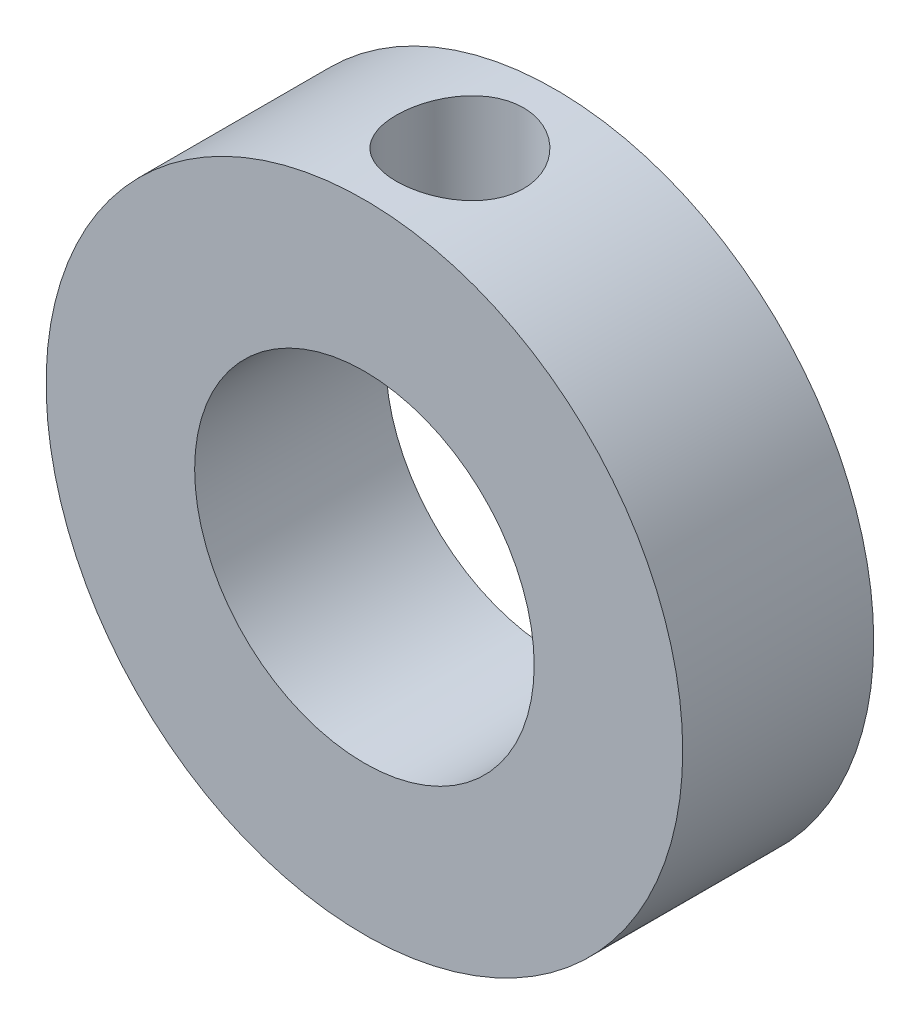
ISO-10303-21;
HEADER;
FILE_DESCRIPTION(('STEP AP214'),'2;1');
FILE_NAME('part.step','',(''),(''),'','','');
FILE_SCHEMA(('AUTOMOTIVE_DESIGN { 1 0 10303 214 1 1 1 1 }'));
ENDSEC;
DATA;
#1=APPLICATION_CONTEXT('core data for automotive mechanical design processes');
#2=APPLICATION_PROTOCOL_DEFINITION('international standard','automotive_design',2000,#1);
#3=PRODUCT_CONTEXT('',#1,'mechanical');
#4=PRODUCT('Part','Part','',(#3));
#5=PRODUCT_RELATED_PRODUCT_CATEGORY('part','',(#4));
#6=PRODUCT_DEFINITION_FORMATION('','',#4);
#7=PRODUCT_DEFINITION_CONTEXT('part definition',#1,'design');
#8=PRODUCT_DEFINITION('design','',#6,#7);
#9=PRODUCT_DEFINITION_SHAPE('','',#8);
#10=(LENGTH_UNIT() NAMED_UNIT(*) SI_UNIT(.MILLI.,.METRE.));
#11=(NAMED_UNIT(*) PLANE_ANGLE_UNIT() SI_UNIT($,.RADIAN.));
#12=(NAMED_UNIT(*) SI_UNIT($,.STERADIAN.) SOLID_ANGLE_UNIT());
#13=UNCERTAINTY_MEASURE_WITH_UNIT(LENGTH_MEASURE(1.E-05),#10,'distance_accuracy_value','');
#14=(GEOMETRIC_REPRESENTATION_CONTEXT(3) GLOBAL_UNCERTAINTY_ASSIGNED_CONTEXT((#13)) GLOBAL_UNIT_ASSIGNED_CONTEXT((#10,
#11,#12)) REPRESENTATION_CONTEXT('',''));
#15=CARTESIAN_POINT('',(0.,0.,0.));
#16=DIRECTION('',(0.,0.,1.));
#17=DIRECTION('',(1.,0.,0.));
#18=AXIS2_PLACEMENT_3D('',#15,#16,#17);
#19=CARTESIAN_POINT('',(0.,0.,4.5));
#20=DIRECTION('',(0.,0.,1.));
#21=DIRECTION('',(1.,0.,0.));
#22=AXIS2_PLACEMENT_3D('',#19,#20,#21);
#23=PLANE('',#22);
#24=CARTESIAN_POINT('',(0.,0.,4.5));
#25=DIRECTION('',(0.,0.,1.));
#26=DIRECTION('',(1.,0.,0.));
#27=AXIS2_PLACEMENT_3D('',#24,#25,#26);
#28=CIRCLE('',#27,15.);
#29=CARTESIAN_POINT('',(15.,0.,4.5));
#30=VERTEX_POINT('',#29);
#31=EDGE_CURVE('E10',#30,#30,#28,.T.);
#32=ORIENTED_EDGE('',*,*,#31,.T.);
#33=EDGE_LOOP('',(#32));
#34=FACE_BOUND('',#33,.T.);
#35=CARTESIAN_POINT('',(0.,0.,4.5));
#36=DIRECTION('',(0.,0.,1.));
#37=DIRECTION('',(1.,0.,0.));
#38=AXIS2_PLACEMENT_3D('',#35,#36,#37);
#39=CIRCLE('',#38,8.);
#40=CARTESIAN_POINT('',(8.,0.,4.5));
#41=VERTEX_POINT('',#40);
#42=EDGE_CURVE('E46',#41,#41,#39,.T.);
#43=ORIENTED_EDGE('',*,*,#42,.F.);
#44=EDGE_LOOP('',(#43));
#45=FACE_BOUND('',#44,.T.);
#46=ADVANCED_FACE('F29',(#34,#45),#23,.T.);
#47=CARTESIAN_POINT('',(0.,0.,-4.5));
#48=DIRECTION('',(0.,0.,1.));
#49=DIRECTION('',(1.,0.,0.));
#50=AXIS2_PLACEMENT_3D('',#47,#48,#49);
#51=PLANE('',#50);
#52=CARTESIAN_POINT('',(0.,0.,-4.5));
#53=DIRECTION('',(0.,0.,1.));
#54=DIRECTION('',(1.,0.,0.));
#55=AXIS2_PLACEMENT_3D('',#52,#53,#54);
#56=CIRCLE('',#55,15.);
#57=CARTESIAN_POINT('',(15.,0.,-4.5));
#58=VERTEX_POINT('',#57);
#59=EDGE_CURVE('E42',#58,#58,#56,.T.);
#60=ORIENTED_EDGE('',*,*,#59,.F.);
#61=EDGE_LOOP('',(#60));
#62=FACE_BOUND('',#61,.T.);
#63=CARTESIAN_POINT('',(0.,0.,-4.5));
#64=DIRECTION('',(0.,0.,1.));
#65=DIRECTION('',(1.,0.,0.));
#66=AXIS2_PLACEMENT_3D('',#63,#64,#65);
#67=CIRCLE('',#66,8.);
#68=CARTESIAN_POINT('',(8.,0.,-4.5));
#69=VERTEX_POINT('',#68);
#70=EDGE_CURVE('E51',#69,#69,#67,.T.);
#71=ORIENTED_EDGE('',*,*,#70,.T.);
#72=EDGE_LOOP('',(#71));
#73=FACE_BOUND('',#72,.T.);
#74=ADVANCED_FACE('F68',(#62,#73),#51,.F.);
#75=CARTESIAN_POINT('',(0.,0.,4.5));
#76=DIRECTION('',(0.,0.,-1.));
#77=DIRECTION('',(-1.,0.,0.));
#78=AXIS2_PLACEMENT_3D('',#75,#76,#77);
#79=CYLINDRICAL_SURFACE('',#78,15.);
#80=CARTESIAN_POINT('',(0.,15.,3.));
#81=CARTESIAN_POINT('',(-0.1667307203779,14.9999969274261,2.99999386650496));
#82=CARTESIAN_POINT('',(-0.333538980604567,14.9971915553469,2.98605347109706));
#83=CARTESIAN_POINT('',(-0.662440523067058,14.9862709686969,2.93070449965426));
#84=CARTESIAN_POINT('',(-0.824529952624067,14.9781515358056,2.88927410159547));
#85=CARTESIAN_POINT('',(-1.13919091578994,14.9575094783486,2.78027617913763));
#86=CARTESIAN_POINT('',(-1.2917714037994,14.9449910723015,2.71273368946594));
#87=CARTESIAN_POINT('',(-1.58342396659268,14.9169119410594,2.55350325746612));
#88=CARTESIAN_POINT('',(-1.72249684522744,14.9013513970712,2.46181675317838));
#89=CARTESIAN_POINT('',(-1.98508043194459,14.8686649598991,2.2555845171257));
#90=CARTESIAN_POINT('',(-2.10838185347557,14.8515223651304,2.14077493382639));
#91=CARTESIAN_POINT('',(-2.33411026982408,14.8177254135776,1.89212275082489));
#92=CARTESIAN_POINT('',(-2.43653563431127,14.8010710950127,1.75827866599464));
#93=CARTESIAN_POINT('',(-2.61849526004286,14.7699732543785,1.47385142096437));
#94=CARTESIAN_POINT('',(-2.6978128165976,14.7555512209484,1.32312706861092));
#95=CARTESIAN_POINT('',(-2.82991699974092,14.7307880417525,1.01015454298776));
#96=CARTESIAN_POINT('',(-2.88270624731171,14.7204464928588,0.847907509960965));
#97=CARTESIAN_POINT('',(-2.95957589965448,14.7051841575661,0.518746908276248));
#98=CARTESIAN_POINT('',(-2.98402349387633,14.7001941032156,0.351922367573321));
#99=CARTESIAN_POINT('',(-3.00465638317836,14.6959912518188,0.0164705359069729));
#100=CARTESIAN_POINT('',(-3.0008445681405,14.6967778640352,-0.152156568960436));
#101=CARTESIAN_POINT('',(-2.96536371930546,14.7039765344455,-0.48374036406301));
#102=CARTESIAN_POINT('',(-2.93411562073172,14.7103035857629,-0.646744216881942));
#103=CARTESIAN_POINT('',(-2.84531365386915,14.7277363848,-0.965148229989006));
#104=CARTESIAN_POINT('',(-2.78775852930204,14.7388423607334,-1.12054802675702));
#105=CARTESIAN_POINT('',(-2.64757435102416,14.7646685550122,-1.4205457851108));
#106=CARTESIAN_POINT('',(-2.56477845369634,14.7794126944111,-1.56506363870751));
#107=CARTESIAN_POINT('',(-2.37658072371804,14.8108385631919,-1.83831254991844));
#108=CARTESIAN_POINT('',(-2.27117629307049,14.827520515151,-1.96704179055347));
#109=CARTESIAN_POINT('',(-2.03849980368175,14.8613106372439,-2.20748820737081));
#110=CARTESIAN_POINT('',(-1.91086848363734,14.8784210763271,-2.31885770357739));
#111=CARTESIAN_POINT('',(-1.63855507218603,14.9108654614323,-2.51866153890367));
#112=CARTESIAN_POINT('',(-1.49387276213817,14.9261993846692,-2.60709558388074));
#113=CARTESIAN_POINT('',(-1.19117816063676,14.9534007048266,-2.75858252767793));
#114=CARTESIAN_POINT('',(-1.0331454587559,14.9652626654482,-2.82159568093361));
#115=CARTESIAN_POINT('',(-0.708446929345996,14.9841422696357,-2.9200814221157));
#116=CARTESIAN_POINT('',(-0.54178215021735,14.9911605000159,-2.95555734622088));
#117=CARTESIAN_POINT('',(-0.207538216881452,14.999480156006,-2.99746936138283));
#118=CARTESIAN_POINT('',(-0.0400209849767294,15.0008752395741,-3.00438125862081));
#119=CARTESIAN_POINT('',(0.293774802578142,14.9980515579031,-2.99025042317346));
#120=CARTESIAN_POINT('',(0.460053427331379,14.9938331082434,-2.96920926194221));
#121=CARTESIAN_POINT('',(0.785116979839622,14.9803149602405,-2.90016487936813));
#122=CARTESIAN_POINT('',(0.94395584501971,14.9710612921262,-2.85240579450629));
#123=CARTESIAN_POINT('',(1.251370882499,14.948506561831,-2.73154805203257));
#124=CARTESIAN_POINT('',(1.39994628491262,14.9352051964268,-2.65844749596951));
#125=CARTESIAN_POINT('',(1.68462352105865,14.9057973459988,-2.48795252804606));
#126=CARTESIAN_POINT('',(1.82055038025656,14.8896585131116,-2.39027165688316));
#127=CARTESIAN_POINT('',(2.07425405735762,14.8564420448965,-2.17377242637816));
#128=CARTESIAN_POINT('',(2.19202892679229,14.8393643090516,-2.0549518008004));
#129=CARTESIAN_POINT('',(2.40792177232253,14.8058791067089,-1.79737994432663));
#130=CARTESIAN_POINT('',(2.50571310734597,14.7894858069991,-1.65835276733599));
#131=CARTESIAN_POINT('',(2.67655626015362,14.7595257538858,-1.36556591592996));
#132=CARTESIAN_POINT('',(2.74960906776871,14.7459588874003,-1.21180683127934));
#133=CARTESIAN_POINT('',(2.86845552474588,14.7233022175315,-0.894695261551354));
#134=CARTESIAN_POINT('',(2.91439049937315,14.7141892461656,-0.731397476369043));
#135=CARTESIAN_POINT('',(2.97812595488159,14.7014231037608,-0.399199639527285));
#136=CARTESIAN_POINT('',(2.99593010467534,14.6977692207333,-0.230300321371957));
#137=CARTESIAN_POINT('',(3.00276273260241,14.6963744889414,0.105026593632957));
#138=CARTESIAN_POINT('',(2.99230736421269,14.698527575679,0.271443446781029));
#139=CARTESIAN_POINT('',(2.94405691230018,14.7082672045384,0.60009494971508));
#140=CARTESIAN_POINT('',(2.90626204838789,14.7158537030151,0.762329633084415));
#141=CARTESIAN_POINT('',(2.80463570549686,14.7355579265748,1.07768313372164));
#142=CARTESIAN_POINT('',(2.74086752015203,14.7476646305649,1.23082308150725));
#143=CARTESIAN_POINT('',(2.58916393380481,14.7750514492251,1.52431116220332));
#144=CARTESIAN_POINT('',(2.50122650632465,14.7903318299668,1.66465822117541));
#145=CARTESIAN_POINT('',(2.30191774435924,14.8226688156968,1.93114671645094));
#146=CARTESIAN_POINT('',(2.19017366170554,14.839751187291,2.05700629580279));
#147=CARTESIAN_POINT('',(1.94719310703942,14.8735824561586,2.28835861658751));
#148=CARTESIAN_POINT('',(1.81595216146,14.8903312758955,2.39384667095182));
#149=CARTESIAN_POINT('',(1.53605288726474,14.9218149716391,2.58250393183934));
#150=CARTESIAN_POINT('',(1.3872266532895,14.9365269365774,2.66542800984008));
#151=CARTESIAN_POINT('',(1.0774990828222,14.96205375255,2.80495836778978));
#152=CARTESIAN_POINT('',(0.916608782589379,14.9728721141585,2.86158836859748));
#153=CARTESIAN_POINT('',(0.629464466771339,14.9872911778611,2.93595584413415));
#154=CARTESIAN_POINT('',(0.504844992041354,14.9920290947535,2.95992958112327));
#155=CARTESIAN_POINT('',(0.253498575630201,14.9983846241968,2.99195373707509));
#156=CARTESIAN_POINT('',(0.126771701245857,15.0000023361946,3.0000046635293));
#157=CARTESIAN_POINT('',(0.,15.,3.));
#158=B_SPLINE_CURVE_WITH_KNOTS('',3,(#80,#81,#82,#83,#84,#85,#86,#87,#88,#89,#90,#91,#92,#93,
#94,#95,#96,#97,#98,#99,#100,#101,#102,#103,#104,#105,#106,#107,#108,#109,#110,#111,#112,#113,
#114,#115,#116,#117,#118,#119,#120,#121,#122,#123,#124,#125,#126,#127,#128,#129,#130,#131,#132,
#133,#134,#135,#136,#137,#138,#139,#140,#141,#142,#143,#144,#145,#146,#147,#148,#149,#150,#151,
#152,#153,#154,#155,#156,#157),.UNSPECIFIED.,.T.,.F.,(4,2,2,2,2,2,2,2,2,2,2,2,2,2,2,2,2,2,2,2,2,
2,2,2,2,2,2,2,2,2,2,2,2,2,2,2,2,2,4),(0.,0.499728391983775,0.999853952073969,1.49950120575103,
1.99911870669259,2.50479801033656,3.0105167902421,3.52083585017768,4.03110448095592,
4.53468555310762,5.03821512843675,5.53415181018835,6.03011217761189,6.52942470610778,
7.02879464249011,7.53714757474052,8.04550702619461,8.55465824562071,9.06374777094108,
9.56432207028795,10.064868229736,10.5609136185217,11.0569961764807,11.5591519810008,
12.0613616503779,12.5712188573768,13.081055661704,13.5882114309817,14.0953010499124,
14.593191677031,15.0910783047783,15.5877588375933,16.084481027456,16.5896422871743,
17.0949196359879,17.6054849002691,18.1155886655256,18.4955632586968,18.8755257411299),.UNSPECIFIED.);
#159=CARTESIAN_POINT('',(0.,15.,3.));
#160=VERTEX_POINT('',#159);
#161=EDGE_CURVE('E54',#160,#160,#158,.T.);
#162=ORIENTED_EDGE('',*,*,#161,.T.);
#163=EDGE_LOOP('',(#162));
#164=FACE_BOUND('',#163,.T.);
#165=ORIENTED_EDGE('',*,*,#31,.F.);
#166=EDGE_LOOP('',(#165));
#167=FACE_BOUND('',#166,.T.);
#168=ORIENTED_EDGE('',*,*,#59,.T.);
#169=EDGE_LOOP('',(#168));
#170=FACE_BOUND('',#169,.T.);
#171=ADVANCED_FACE('F31',(#164,#167,#170),#79,.T.);
#172=CARTESIAN_POINT('',(0.,0.,4.5));
#173=DIRECTION('',(0.,0.,-1.));
#174=DIRECTION('',(-1.,0.,0.));
#175=AXIS2_PLACEMENT_3D('',#172,#173,#174);
#176=CYLINDRICAL_SURFACE('',#175,8.);
#177=CARTESIAN_POINT('',(0.,8.,3.));
#178=CARTESIAN_POINT('',(-0.162470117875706,8.00000434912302,3.00000580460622));
#179=CARTESIAN_POINT('',(-0.324900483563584,7.99500758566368,2.98676047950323));
#180=CARTESIAN_POINT('',(-0.644906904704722,7.97557392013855,2.93434360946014));
#181=CARTESIAN_POINT('',(-0.802483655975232,7.96113837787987,2.89517579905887));
#182=CARTESIAN_POINT('',(-1.10812156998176,7.92437664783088,2.79249399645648));
#183=CARTESIAN_POINT('',(-1.25620044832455,7.90206568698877,2.72902696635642));
#184=CARTESIAN_POINT('',(-1.53959862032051,7.85177535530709,2.57978717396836));
#185=CARTESIAN_POINT('',(-1.67491447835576,7.82379446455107,2.4940084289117));
#186=CARTESIAN_POINT('',(-1.93469283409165,7.76372493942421,2.29877493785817));
#187=CARTESIAN_POINT('',(-2.05854146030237,7.73152005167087,2.18853947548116));
#188=CARTESIAN_POINT('',(-2.28648842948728,7.66720441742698,1.94917913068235));
#189=CARTESIAN_POINT('',(-2.39058072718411,7.63509370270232,1.82004848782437));
#190=CARTESIAN_POINT('',(-2.57996404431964,7.5732494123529,1.54056506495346));
#191=CARTESIAN_POINT('',(-2.66438786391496,7.5436529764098,1.3895912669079));
#192=CARTESIAN_POINT('',(-2.80637292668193,7.49199720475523,1.07430329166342));
#193=CARTESIAN_POINT('',(-2.86394489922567,7.46993485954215,0.909994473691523));
#194=CARTESIAN_POINT('',(-2.94816862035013,7.43708825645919,0.579766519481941));
#195=CARTESIAN_POINT('',(-2.97599186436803,7.42587848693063,0.414189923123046));
#196=CARTESIAN_POINT('',(-3.00359113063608,7.41476122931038,0.0803676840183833));
#197=CARTESIAN_POINT('',(-3.00337873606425,7.41484907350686,-0.0878768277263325));
#198=CARTESIAN_POINT('',(-2.97580859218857,7.42595023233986,-0.411539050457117));
#199=CARTESIAN_POINT('',(-2.95007617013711,7.43630937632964,-0.567121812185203));
#200=CARTESIAN_POINT('',(-2.87488335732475,7.46569876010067,-0.871574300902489));
#201=CARTESIAN_POINT('',(-2.82541939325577,7.48473030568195,-1.020443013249));
#202=CARTESIAN_POINT('',(-2.70327497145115,7.52971404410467,-1.31055413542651));
#203=CARTESIAN_POINT('',(-2.63017297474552,7.55579035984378,-1.45159897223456));
#204=CARTESIAN_POINT('',(-2.46312147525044,7.61188420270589,-1.71989147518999));
#205=CARTESIAN_POINT('',(-2.36916477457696,7.64190308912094,-1.84713435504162));
#206=CARTESIAN_POINT('',(-2.15563561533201,7.70496077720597,-2.09320732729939));
#207=CARTESIAN_POINT('',(-2.03476597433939,7.73806694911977,-2.21089728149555));
#208=CARTESIAN_POINT('',(-1.77462518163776,7.80183456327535,-2.42467593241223));
#209=CARTESIAN_POINT('',(-1.63535120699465,7.83249562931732,-2.52076130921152));
#210=CARTESIAN_POINT('',(-1.33944687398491,7.88852789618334,-2.68986079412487));
#211=CARTESIAN_POINT('',(-1.18258142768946,7.91380996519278,-2.76249516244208));
#212=CARTESIAN_POINT('',(-0.857673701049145,7.95557436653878,-2.87996520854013));
#213=CARTESIAN_POINT('',(-0.689636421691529,7.97206060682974,-2.92481323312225));
#214=CARTESIAN_POINT('',(-0.356750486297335,7.99368886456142,-2.98324557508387));
#215=CARTESIAN_POINT('',(-0.192207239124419,7.99938738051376,-2.99836521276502));
#216=CARTESIAN_POINT('',(0.137144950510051,8.00051787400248,-3.00138212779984));
#217=CARTESIAN_POINT('',(0.301953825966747,7.99595212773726,-2.98928544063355));
#218=CARTESIAN_POINT('',(0.620524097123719,7.97743419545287,-2.93937991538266));
#219=CARTESIAN_POINT('',(0.774466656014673,7.9638494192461,-2.90257691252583));
#220=CARTESIAN_POINT('',(1.07388350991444,7.92902954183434,-2.80562785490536));
#221=CARTESIAN_POINT('',(1.21935670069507,7.9077934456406,-2.74547876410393));
#222=CARTESIAN_POINT('',(1.50249553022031,7.85899248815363,-2.60162717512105));
#223=CARTESIAN_POINT('',(1.63980616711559,7.83126000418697,-2.51728454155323));
#224=CARTESIAN_POINT('',(1.89878542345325,7.77253343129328,-2.32816379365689));
#225=CARTESIAN_POINT('',(2.0204482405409,7.74153814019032,-2.2233781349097));
#226=CARTESIAN_POINT('',(2.25206159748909,7.67746658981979,-1.98919175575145));
#227=CARTESIAN_POINT('',(2.36092308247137,7.64437393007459,-1.8587156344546));
#228=CARTESIAN_POINT('',(2.55542100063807,7.58157631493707,-1.58069723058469));
#229=CARTESIAN_POINT('',(2.64105534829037,7.55187166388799,-1.433153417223));
#230=CARTESIAN_POINT('',(2.78675547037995,7.49933659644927,-1.12396802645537));
#231=CARTESIAN_POINT('',(2.84671370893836,7.47653520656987,-0.962270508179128));
#232=CARTESIAN_POINT('',(2.93815766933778,7.4410806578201,-0.629980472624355));
#233=CARTESIAN_POINT('',(2.9696610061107,7.42842122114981,-0.459393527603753));
#234=CARTESIAN_POINT('',(3.00172694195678,7.41551789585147,-0.125967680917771));
#235=CARTESIAN_POINT('',(3.00414662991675,7.41452889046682,0.0366652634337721));
#236=CARTESIAN_POINT('',(2.98273431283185,7.42316825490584,0.359890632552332));
#237=CARTESIAN_POINT('',(2.95890479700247,7.43279561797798,0.520483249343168));
#238=CARTESIAN_POINT('',(2.88711631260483,7.46096283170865,0.830094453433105));
#239=CARTESIAN_POINT('',(2.83991596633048,7.47922170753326,0.979316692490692));
#240=CARTESIAN_POINT('',(2.72339393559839,7.52243096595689,1.26781101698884));
#241=CARTESIAN_POINT('',(2.65406665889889,7.54738303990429,1.40708057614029));
#242=CARTESIAN_POINT('',(2.49104151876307,7.60279447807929,1.67965357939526));
#243=CARTESIAN_POINT('',(2.3962566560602,7.63347396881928,1.81226159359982));
#244=CARTESIAN_POINT('',(2.18668971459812,7.69612493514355,2.06028312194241));
#245=CARTESIAN_POINT('',(2.07190128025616,7.7280968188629,2.17569114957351));
#246=CARTESIAN_POINT('',(1.81816079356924,7.79180849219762,2.39240391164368));
#247=CARTESIAN_POINT('',(1.67823728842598,7.82344209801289,2.49260750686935));
#248=CARTESIAN_POINT('',(1.38242644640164,7.88109028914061,2.66804531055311));
#249=CARTESIAN_POINT('',(1.22653786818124,7.90710443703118,2.74327757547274));
#250=CARTESIAN_POINT('',(0.895998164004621,7.9514858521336,2.86875365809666));
#251=CARTESIAN_POINT('',(0.720826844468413,7.96947314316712,2.91777412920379));
#252=CARTESIAN_POINT('',(0.363751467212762,7.99372484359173,2.98338591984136));
#253=CARTESIAN_POINT('',(0.181850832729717,7.99999513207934,2.99999350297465));
#254=CARTESIAN_POINT('',(0.,8.,3.));
#255=B_SPLINE_CURVE_WITH_KNOTS('',3,(#177,#178,#179,#180,#181,#182,#183,#184,#185,#186,#187,
#188,#189,#190,#191,#192,#193,#194,#195,#196,#197,#198,#199,#200,#201,#202,#203,#204,#205,#206,
#207,#208,#209,#210,#211,#212,#213,#214,#215,#216,#217,#218,#219,#220,#221,#222,#223,#224,#225,
#226,#227,#228,#229,#230,#231,#232,#233,#234,#235,#236,#237,#238,#239,#240,#241,#242,#243,#244,
#245,#246,#247,#248,#249,#250,#251,#252,#253,#254),.UNSPECIFIED.,.T.,.F.,(4,2,2,2,2,2,2,2,2,2,2,
2,2,2,2,2,2,2,2,2,2,2,2,2,2,2,2,2,2,2,2,2,2,2,2,2,2,2,4),(0.,0.48673960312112,0.973409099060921,
1.45914273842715,1.94500675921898,2.44947237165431,2.95409209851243,3.47793349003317,
4.00156538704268,4.50371748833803,5.00566212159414,5.47756690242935,5.94954276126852,
6.43044816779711,6.91151981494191,7.42492306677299,7.93840515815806,8.45982750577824,
8.98101799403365,9.47450039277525,9.96787336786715,10.4422887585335,10.9167658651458,
11.4051844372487,11.8937836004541,12.4107303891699,12.9277235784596,13.4468613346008,
13.9656774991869,14.4511752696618,14.9366270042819,15.4072628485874,15.8780177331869,
16.3734494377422,16.869038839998,17.3914465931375,17.9138949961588,18.4589703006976,
19.0037720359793),.UNSPECIFIED.);
#256=CARTESIAN_POINT('',(0.,8.,3.));
#257=VERTEX_POINT('',#256);
#258=EDGE_CURVE('E34',#257,#257,#255,.T.);
#259=ORIENTED_EDGE('',*,*,#258,.F.);
#260=EDGE_LOOP('',(#259));
#261=FACE_BOUND('',#260,.T.);
#262=ORIENTED_EDGE('',*,*,#42,.T.);
#263=EDGE_LOOP('',(#262));
#264=FACE_BOUND('',#263,.T.);
#265=ORIENTED_EDGE('',*,*,#70,.F.);
#266=EDGE_LOOP('',(#265));
#267=FACE_BOUND('',#266,.T.);
#268=ADVANCED_FACE('F61',(#261,#264,#267),#176,.F.);
#269=CARTESIAN_POINT('',(0.,6.,0.));
#270=DIRECTION('',(0.,1.,0.));
#271=DIRECTION('',(0.,0.,1.));
#272=AXIS2_PLACEMENT_3D('',#269,#270,#271);
#273=CYLINDRICAL_SURFACE('',#272,3.);
#274=ORIENTED_EDGE('',*,*,#258,.T.);
#275=EDGE_LOOP('',(#274));
#276=FACE_BOUND('',#275,.T.);
#277=ORIENTED_EDGE('',*,*,#161,.F.);
#278=EDGE_LOOP('',(#277));
#279=FACE_BOUND('',#278,.T.);
#280=ADVANCED_FACE('F58',(#276,#279),#273,.F.);
#281=CLOSED_SHELL('',(#46,#74,#171,#268,#280));
#282=MANIFOLD_SOLID_BREP('B2',#281);
#283=ADVANCED_BREP_SHAPE_REPRESENTATION('',(#18,#282),#14);
#284=SHAPE_DEFINITION_REPRESENTATION(#9,#283);
ENDSEC;
END-ISO-10303-21;
